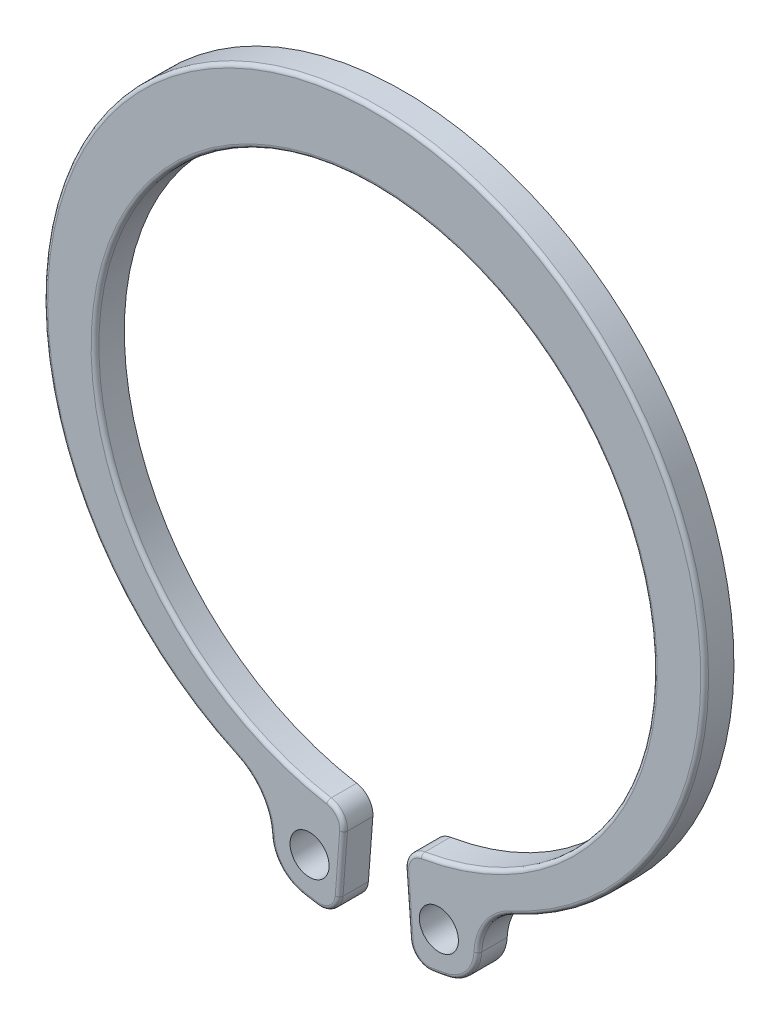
ISO-10303-21;
HEADER;
FILE_DESCRIPTION(('STEP AP214'),'2;1');
FILE_NAME('part.step','',(''),(''),'','','');
FILE_SCHEMA(('AUTOMOTIVE_DESIGN { 1 0 10303 214 1 1 1 1 }'));
ENDSEC;
DATA;
#1=APPLICATION_CONTEXT('core data for automotive mechanical design processes');
#2=APPLICATION_PROTOCOL_DEFINITION('international standard','automotive_design',2000,#1);
#3=PRODUCT_CONTEXT('',#1,'mechanical');
#4=PRODUCT('Part','Part','',(#3));
#5=PRODUCT_RELATED_PRODUCT_CATEGORY('part','',(#4));
#6=PRODUCT_DEFINITION_FORMATION('','',#4);
#7=PRODUCT_DEFINITION_CONTEXT('part definition',#1,'design');
#8=PRODUCT_DEFINITION('design','',#6,#7);
#9=PRODUCT_DEFINITION_SHAPE('','',#8);
#10=(LENGTH_UNIT() NAMED_UNIT(*) SI_UNIT(.MILLI.,.METRE.));
#11=(NAMED_UNIT(*) PLANE_ANGLE_UNIT() SI_UNIT($,.RADIAN.));
#12=(NAMED_UNIT(*) SI_UNIT($,.STERADIAN.) SOLID_ANGLE_UNIT());
#13=UNCERTAINTY_MEASURE_WITH_UNIT(LENGTH_MEASURE(1.E-05),#10,'distance_accuracy_value','');
#14=(GEOMETRIC_REPRESENTATION_CONTEXT(3) GLOBAL_UNCERTAINTY_ASSIGNED_CONTEXT((#13)) GLOBAL_UNIT_ASSIGNED_CONTEXT((#10,
#11,#12)) REPRESENTATION_CONTEXT('',''));
#15=CARTESIAN_POINT('',(0.,0.,0.));
#16=DIRECTION('',(0.,0.,1.));
#17=DIRECTION('',(1.,0.,0.));
#18=AXIS2_PLACEMENT_3D('',#15,#16,#17);
#19=CARTESIAN_POINT('',(0.,0.,1.5));
#20=DIRECTION('',(0.,0.,1.));
#21=DIRECTION('',(1.,0.,0.));
#22=AXIS2_PLACEMENT_3D('',#19,#20,#21);
#23=PLANE('',#22);
#24=DIRECTION('',(0.0761165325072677,0.997098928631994,0.));
#25=VECTOR('',#24,1.);
#26=CARTESIAN_POINT('',(-1.76789289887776,-15.1442562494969,1.5));
#27=LINE('',#26,#25);
#28=CARTESIAN_POINT('',(-1.99694134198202,-18.1447076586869,1.5));
#29=VERTEX_POINT('',#28);
#30=CARTESIAN_POINT('',(-1.76789289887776,-15.1442562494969,1.5));
#31=VERTEX_POINT('',#30);
#32=EDGE_CURVE('E277',#29,#31,#27,.T.);
#33=ORIENTED_EDGE('',*,*,#32,.T.);
#34=CARTESIAN_POINT('',(-2.56557204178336,-15.0833630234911,1.5));
#35=DIRECTION('',(0.,0.,1.));
#36=DIRECTION('',(1.,0.,0.));
#37=AXIS2_PLACEMENT_3D('',#34,#35,#36);
#38=CIRCLE('',#37,0.8);
#39=CARTESIAN_POINT('',(-2.43142448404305,-14.2946904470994,1.5));
#40=VERTEX_POINT('',#39);
#41=EDGE_CURVE('E279',#31,#40,#38,.T.);
#42=ORIENTED_EDGE('',*,*,#41,.T.);
#43=CARTESIAN_POINT('',(0.,0.,1.5));
#44=DIRECTION('',(0.,0.,1.));
#45=DIRECTION('',(1.,0.,0.));
#46=AXIS2_PLACEMENT_3D('',#43,#44,#45);
#47=CIRCLE('',#46,14.5);
#48=CARTESIAN_POINT('',(2.43142448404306,-14.2946904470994,1.5));
#49=VERTEX_POINT('',#48);
#50=EDGE_CURVE('E253',#40,#49,#47,.F.);
#51=ORIENTED_EDGE('',*,*,#50,.T.);
#52=CARTESIAN_POINT('',(2.56557204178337,-15.0833630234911,1.5));
#53=DIRECTION('',(0.,0.,1.));
#54=DIRECTION('',(1.,0.,0.));
#55=AXIS2_PLACEMENT_3D('',#52,#53,#54);
#56=CIRCLE('',#55,0.8);
#57=CARTESIAN_POINT('',(1.76789289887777,-15.1442562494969,1.5));
#58=VERTEX_POINT('',#57);
#59=EDGE_CURVE('E255',#49,#58,#56,.T.);
#60=ORIENTED_EDGE('',*,*,#59,.T.);
#61=DIRECTION('',(0.076116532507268,-0.997098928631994,0.));
#62=VECTOR('',#61,1.);
#63=CARTESIAN_POINT('',(1.99694134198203,-18.1447076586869,1.5));
#64=LINE('',#63,#62);
#65=CARTESIAN_POINT('',(1.99694134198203,-18.1447076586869,1.5));
#66=VERTEX_POINT('',#65);
#67=EDGE_CURVE('E257',#58,#66,#64,.T.);
#68=ORIENTED_EDGE('',*,*,#67,.T.);
#69=CARTESIAN_POINT('',(2.79462048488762,-18.083814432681,1.5));
#70=DIRECTION('',(0.,0.,1.));
#71=DIRECTION('',(1.,0.,0.));
#72=AXIS2_PLACEMENT_3D('',#69,#70,#71);
#73=CIRCLE('',#72,0.8);
#74=CARTESIAN_POINT('',(2.91679985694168,-18.8744295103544,1.5));
#75=VERTEX_POINT('',#74);
#76=EDGE_CURVE('E259',#66,#75,#73,.T.);
#77=ORIENTED_EDGE('',*,*,#76,.T.);
#78=CARTESIAN_POINT('',(0.,0.,1.5));
#79=DIRECTION('',(0.,0.,1.));
#80=DIRECTION('',(1.,0.,0.));
#81=AXIS2_PLACEMENT_3D('',#78,#79,#80);
#82=CIRCLE('',#81,19.0984766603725);
#83=CARTESIAN_POINT('',(3.6566155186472,-18.7451586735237,1.5));
#84=VERTEX_POINT('',#83);
#85=EDGE_CURVE('E261',#75,#84,#82,.T.);
#86=ORIENTED_EDGE('',*,*,#85,.T.);
#87=CARTESIAN_POINT('',(3.31198552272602,-16.9784583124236,1.5));
#88=DIRECTION('',(0.,0.,1.));
#89=DIRECTION('',(1.,0.,0.));
#90=AXIS2_PLACEMENT_3D('',#87,#88,#89);
#91=CIRCLE('',#90,1.8);
#92=CARTESIAN_POINT('',(5.1095864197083,-17.0713615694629,1.5));
#93=VERTEX_POINT('',#92);
#94=EDGE_CURVE('E263',#84,#93,#91,.T.);
#95=ORIENTED_EDGE('',*,*,#94,.T.);
#96=CARTESIAN_POINT('',(8.30532134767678,-17.2365229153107,1.5));
#97=DIRECTION('',(0.,0.,1.));
#98=DIRECTION('',(1.,0.,0.));
#99=AXIS2_PLACEMENT_3D('',#96,#97,#98);
#100=CIRCLE('',#99,3.2);
#101=CARTESIAN_POINT('',(6.97146798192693,-14.327771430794,1.5));
#102=VERTEX_POINT('',#101);
#103=EDGE_CURVE('E265',#93,#102,#100,.F.);
#104=ORIENTED_EDGE('',*,*,#103,.T.);
#105=CARTESIAN_POINT('',(0.,0.875,1.5));
#106=DIRECTION('',(0.,0.,1.));
#107=DIRECTION('',(1.,0.,0.));
#108=AXIS2_PLACEMENT_3D('',#105,#106,#107);
#109=CIRCLE('',#108,16.725);
#110=CARTESIAN_POINT('',(-6.97146798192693,-14.327771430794,1.5));
#111=VERTEX_POINT('',#110);
#112=EDGE_CURVE('E267',#102,#111,#109,.T.);
#113=ORIENTED_EDGE('',*,*,#112,.T.);
#114=CARTESIAN_POINT('',(-8.30532134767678,-17.2365229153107,1.5));
#115=DIRECTION('',(0.,0.,1.));
#116=DIRECTION('',(1.,0.,0.));
#117=AXIS2_PLACEMENT_3D('',#114,#115,#116);
#118=CIRCLE('',#117,3.2);
#119=CARTESIAN_POINT('',(-5.10958641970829,-17.0713615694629,1.5));
#120=VERTEX_POINT('',#119);
#121=EDGE_CURVE('E269',#111,#120,#118,.F.);
#122=ORIENTED_EDGE('',*,*,#121,.T.);
#123=CARTESIAN_POINT('',(-3.31198552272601,-16.9784583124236,1.5));
#124=DIRECTION('',(0.,0.,1.));
#125=DIRECTION('',(1.,0.,0.));
#126=AXIS2_PLACEMENT_3D('',#123,#124,#125);
#127=CIRCLE('',#126,1.8);
#128=CARTESIAN_POINT('',(-3.65661551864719,-18.7451586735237,1.5));
#129=VERTEX_POINT('',#128);
#130=EDGE_CURVE('E271',#120,#129,#127,.T.);
#131=ORIENTED_EDGE('',*,*,#130,.T.);
#132=CARTESIAN_POINT('',(0.,0.,1.5));
#133=DIRECTION('',(0.,0.,1.));
#134=DIRECTION('',(1.,0.,0.));
#135=AXIS2_PLACEMENT_3D('',#132,#133,#134);
#136=CIRCLE('',#135,19.0984766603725);
#137=CARTESIAN_POINT('',(-2.91679985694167,-18.8744295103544,1.5));
#138=VERTEX_POINT('',#137);
#139=EDGE_CURVE('E273',#129,#138,#136,.T.);
#140=ORIENTED_EDGE('',*,*,#139,.T.);
#141=CARTESIAN_POINT('',(-2.79462048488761,-18.083814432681,1.5));
#142=DIRECTION('',(0.,0.,1.));
#143=DIRECTION('',(1.,0.,0.));
#144=AXIS2_PLACEMENT_3D('',#141,#142,#143);
#145=CIRCLE('',#144,0.8);
#146=EDGE_CURVE('E275',#138,#29,#145,.T.);
#147=ORIENTED_EDGE('',*,*,#146,.T.);
#148=EDGE_LOOP('',(#33,#42,#51,#60,#68,#77,#86,#95,#104,#113,#122,#131,#140,#147));
#149=FACE_BOUND('',#148,.T.);
#150=CARTESIAN_POINT('',(-3.31198552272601,-16.9784583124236,1.5));
#151=DIRECTION('',(0.,0.,1.));
#152=DIRECTION('',(-1.,0.,0.));
#153=AXIS2_PLACEMENT_3D('',#150,#151,#152);
#154=CIRCLE('',#153,1.);
#155=CARTESIAN_POINT('',(-4.31198552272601,-16.9784583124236,1.5));
#156=VERTEX_POINT('',#155);
#157=EDGE_CURVE('E412',#156,#156,#154,.T.);
#158=ORIENTED_EDGE('',*,*,#157,.F.);
#159=EDGE_LOOP('',(#158));
#160=FACE_BOUND('',#159,.T.);
#161=CARTESIAN_POINT('',(3.31198552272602,-16.9784583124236,1.5));
#162=DIRECTION('',(0.,0.,1.));
#163=DIRECTION('',(1.,0.,0.));
#164=AXIS2_PLACEMENT_3D('',#161,#162,#163);
#165=CIRCLE('',#164,1.);
#166=CARTESIAN_POINT('',(4.31198552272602,-16.9784583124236,1.5));
#167=VERTEX_POINT('',#166);
#168=EDGE_CURVE('E406',#167,#167,#165,.T.);
#169=ORIENTED_EDGE('',*,*,#168,.F.);
#170=EDGE_LOOP('',(#169));
#171=FACE_BOUND('',#170,.T.);
#172=ADVANCED_FACE('F30',(#149,#160,#171),#23,.T.);
#173=CARTESIAN_POINT('',(0.,0.,0.));
#174=DIRECTION('',(0.,0.,1.));
#175=DIRECTION('',(1.,0.,0.));
#176=AXIS2_PLACEMENT_3D('',#173,#174,#175);
#177=PLANE('',#176);
#178=CARTESIAN_POINT('',(-3.31198552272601,-16.9784583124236,0.));
#179=DIRECTION('',(0.,0.,1.));
#180=DIRECTION('',(-1.,0.,0.));
#181=AXIS2_PLACEMENT_3D('',#178,#179,#180);
#182=CIRCLE('',#181,1.);
#183=CARTESIAN_POINT('',(-4.31198552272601,-16.9784583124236,0.));
#184=VERTEX_POINT('',#183);
#185=EDGE_CURVE('E409',#184,#184,#182,.T.);
#186=ORIENTED_EDGE('',*,*,#185,.T.);
#187=EDGE_LOOP('',(#186));
#188=FACE_BOUND('',#187,.T.);
#189=CARTESIAN_POINT('',(0.,0.,0.));
#190=DIRECTION('',(0.,0.,1.));
#191=DIRECTION('',(1.,0.,0.));
#192=AXIS2_PLACEMENT_3D('',#189,#190,#191);
#193=CIRCLE('',#192,19.2984766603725);
#194=CARTESIAN_POINT('',(2.94734469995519,-19.0720832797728,0.));
#195=VERTEX_POINT('',#194);
#196=CARTESIAN_POINT('',(3.69490774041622,-18.941458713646,0.));
#197=VERTEX_POINT('',#196);
#198=EDGE_CURVE('E188',#195,#197,#193,.T.);
#199=ORIENTED_EDGE('',*,*,#198,.F.);
#200=CARTESIAN_POINT('',(2.79462048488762,-18.083814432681,0.));
#201=DIRECTION('',(0.,0.,1.));
#202=DIRECTION('',(1.,0.,0.));
#203=AXIS2_PLACEMENT_3D('',#200,#201,#202);
#204=CIRCLE('',#203,1.);
#205=CARTESIAN_POINT('',(1.79752155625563,-18.1599309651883,0.));
#206=VERTEX_POINT('',#205);
#207=EDGE_CURVE('E235',#195,#206,#204,.F.);
#208=ORIENTED_EDGE('',*,*,#207,.T.);
#209=DIRECTION('',(0.076116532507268,-0.997098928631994,0.));
#210=VECTOR('',#209,1.);
#211=CARTESIAN_POINT('',(1.49686515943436,-14.2214413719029,0.));
#212=LINE('',#211,#210);
#213=CARTESIAN_POINT('',(1.56847311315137,-15.1594795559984,0.));
#214=VERTEX_POINT('',#213);
#215=EDGE_CURVE('E193',#214,#206,#212,.T.);
#216=ORIENTED_EDGE('',*,*,#215,.F.);
#217=CARTESIAN_POINT('',(2.56557204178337,-15.0833630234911,0.));
#218=DIRECTION('',(0.,0.,1.));
#219=DIRECTION('',(1.,0.,0.));
#220=AXIS2_PLACEMENT_3D('',#217,#218,#219);
#221=CIRCLE('',#220,1.);
#222=CARTESIAN_POINT('',(2.39788759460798,-14.0975223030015,0.));
#223=VERTEX_POINT('',#222);
#224=EDGE_CURVE('E231',#214,#223,#221,.F.);
#225=ORIENTED_EDGE('',*,*,#224,.T.);
#226=CARTESIAN_POINT('',(0.,0.,0.));
#227=DIRECTION('',(0.,0.,-1.));
#228=DIRECTION('',(1.,0.,0.));
#229=AXIS2_PLACEMENT_3D('',#226,#227,#228);
#230=CIRCLE('',#229,14.3);
#231=CARTESIAN_POINT('',(-2.39788759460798,-14.0975223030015,0.));
#232=VERTEX_POINT('',#231);
#233=EDGE_CURVE('E415',#232,#223,#230,.T.);
#234=ORIENTED_EDGE('',*,*,#233,.F.);
#235=CARTESIAN_POINT('',(-2.56557204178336,-15.0833630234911,0.));
#236=DIRECTION('',(0.,0.,1.));
#237=DIRECTION('',(1.,0.,0.));
#238=AXIS2_PLACEMENT_3D('',#235,#236,#237);
#239=CIRCLE('',#238,1.);
#240=CARTESIAN_POINT('',(-1.56847311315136,-15.1594795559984,0.));
#241=VERTEX_POINT('',#240);
#242=EDGE_CURVE('E229',#232,#241,#239,.F.);
#243=ORIENTED_EDGE('',*,*,#242,.T.);
#244=DIRECTION('',(0.0761165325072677,0.997098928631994,0.));
#245=VECTOR('',#244,1.);
#246=CARTESIAN_POINT('',(-1.49686515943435,-14.2214413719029,0.));
#247=LINE('',#246,#245);
#248=CARTESIAN_POINT('',(-1.79752155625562,-18.1599309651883,0.));
#249=VERTEX_POINT('',#248);
#250=EDGE_CURVE('E216',#249,#241,#247,.T.);
#251=ORIENTED_EDGE('',*,*,#250,.F.);
#252=CARTESIAN_POINT('',(-2.79462048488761,-18.083814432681,0.));
#253=DIRECTION('',(0.,0.,1.));
#254=DIRECTION('',(1.,0.,0.));
#255=AXIS2_PLACEMENT_3D('',#252,#253,#254);
#256=CIRCLE('',#255,1.);
#257=CARTESIAN_POINT('',(-2.94734469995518,-19.0720832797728,0.));
#258=VERTEX_POINT('',#257);
#259=EDGE_CURVE('E233',#249,#258,#256,.F.);
#260=ORIENTED_EDGE('',*,*,#259,.T.);
#261=CARTESIAN_POINT('',(0.,0.,0.));
#262=DIRECTION('',(0.,0.,1.));
#263=DIRECTION('',(-1.,0.,0.));
#264=AXIS2_PLACEMENT_3D('',#261,#262,#263);
#265=CIRCLE('',#264,19.2984766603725);
#266=CARTESIAN_POINT('',(-3.69490774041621,-18.941458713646,0.));
#267=VERTEX_POINT('',#266);
#268=EDGE_CURVE('E213',#267,#258,#265,.T.);
#269=ORIENTED_EDGE('',*,*,#268,.F.);
#270=CARTESIAN_POINT('',(-3.31198552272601,-16.9784583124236,0.));
#271=DIRECTION('',(0.,0.,1.));
#272=DIRECTION('',(-1.,0.,0.));
#273=AXIS2_PLACEMENT_3D('',#270,#271,#272);
#274=CIRCLE('',#273,2.);
#275=CARTESIAN_POINT('',(-5.30931985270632,-17.0816841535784,0.));
#276=VERTEX_POINT('',#275);
#277=EDGE_CURVE('E210',#276,#267,#274,.T.);
#278=ORIENTED_EDGE('',*,*,#277,.F.);
#279=CARTESIAN_POINT('',(-8.30532134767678,-17.2365229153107,0.));
#280=DIRECTION('',(0.,0.,-1.));
#281=DIRECTION('',(-1.,0.,0.));
#282=AXIS2_PLACEMENT_3D('',#279,#280,#281);
#283=CIRCLE('',#282,3.);
#284=CARTESIAN_POINT('',(-7.05483381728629,-14.5095683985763,0.));
#285=VERTEX_POINT('',#284);
#286=EDGE_CURVE('E207',#285,#276,#283,.T.);
#287=ORIENTED_EDGE('',*,*,#286,.F.);
#288=CARTESIAN_POINT('',(0.,0.875,0.));
#289=DIRECTION('',(0.,0.,1.));
#290=DIRECTION('',(1.,0.,0.));
#291=AXIS2_PLACEMENT_3D('',#288,#289,#290);
#292=CIRCLE('',#291,16.925);
#293=CARTESIAN_POINT('',(7.0548338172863,-14.5095683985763,0.));
#294=VERTEX_POINT('',#293);
#295=EDGE_CURVE('E201',#294,#285,#292,.T.);
#296=ORIENTED_EDGE('',*,*,#295,.F.);
#297=CARTESIAN_POINT('',(8.30532134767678,-17.2365229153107,0.));
#298=DIRECTION('',(0.,0.,-1.));
#299=DIRECTION('',(1.,0.,0.));
#300=AXIS2_PLACEMENT_3D('',#297,#298,#299);
#301=CIRCLE('',#300,3.);
#302=CARTESIAN_POINT('',(5.30931985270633,-17.0816841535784,0.));
#303=VERTEX_POINT('',#302);
#304=EDGE_CURVE('E199',#303,#294,#301,.T.);
#305=ORIENTED_EDGE('',*,*,#304,.F.);
#306=CARTESIAN_POINT('',(3.31198552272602,-16.9784583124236,0.));
#307=DIRECTION('',(0.,0.,1.));
#308=DIRECTION('',(1.,0.,0.));
#309=AXIS2_PLACEMENT_3D('',#306,#307,#308);
#310=CIRCLE('',#309,2.);
#311=EDGE_CURVE('E178',#197,#303,#310,.T.);
#312=ORIENTED_EDGE('',*,*,#311,.F.);
#313=EDGE_LOOP('',(#199,#208,#216,#225,#234,#243,#251,#260,#269,#278,#287,#296,#305,#312));
#314=FACE_BOUND('',#313,.T.);
#315=CARTESIAN_POINT('',(3.31198552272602,-16.9784583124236,0.));
#316=DIRECTION('',(0.,0.,1.));
#317=DIRECTION('',(1.,0.,0.));
#318=AXIS2_PLACEMENT_3D('',#315,#316,#317);
#319=CIRCLE('',#318,1.);
#320=CARTESIAN_POINT('',(4.31198552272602,-16.9784583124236,0.));
#321=VERTEX_POINT('',#320);
#322=EDGE_CURVE('E403',#321,#321,#319,.T.);
#323=ORIENTED_EDGE('',*,*,#322,.T.);
#324=EDGE_LOOP('',(#323));
#325=FACE_BOUND('',#324,.T.);
#326=ADVANCED_FACE('F195',(#188,#314,#325),#177,.F.);
#327=CARTESIAN_POINT('',(0.,0.,1.5));
#328=DIRECTION('',(0.,0.,-1.));
#329=DIRECTION('',(-1.,0.,0.));
#330=AXIS2_PLACEMENT_3D('',#327,#328,#329);
#331=CYLINDRICAL_SURFACE('',#330,14.3);
#332=DIRECTION('',(0.,0.,-1.));
#333=VECTOR('',#332,1.);
#334=CARTESIAN_POINT('',(2.39788759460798,-14.0975223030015,1.5));
#335=LINE('',#334,#333);
#336=CARTESIAN_POINT('',(2.39788759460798,-14.0975223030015,1.3));
#337=VERTEX_POINT('',#336);
#338=EDGE_CURVE('E251',#223,#337,#335,.F.);
#339=ORIENTED_EDGE('',*,*,#338,.T.);
#340=CARTESIAN_POINT('',(0.,0.,1.3));
#341=DIRECTION('',(0.,0.,1.));
#342=DIRECTION('',(1.,0.,0.));
#343=AXIS2_PLACEMENT_3D('',#340,#341,#342);
#344=CIRCLE('',#343,14.3);
#345=CARTESIAN_POINT('',(-2.39788759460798,-14.0975223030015,1.3));
#346=VERTEX_POINT('',#345);
#347=EDGE_CURVE('E11',#337,#346,#344,.T.);
#348=ORIENTED_EDGE('',*,*,#347,.T.);
#349=DIRECTION('',(0.,0.,-1.));
#350=VECTOR('',#349,1.);
#351=CARTESIAN_POINT('',(-2.39788759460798,-14.0975223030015,1.5));
#352=LINE('',#351,#350);
#353=EDGE_CURVE('E249',#346,#232,#352,.T.);
#354=ORIENTED_EDGE('',*,*,#353,.T.);
#355=ORIENTED_EDGE('',*,*,#233,.T.);
#356=EDGE_LOOP('',(#339,#348,#354,#355));
#357=FACE_BOUND('',#356,.T.);
#358=ADVANCED_FACE('F32',(#357),#331,.F.);
#359=CARTESIAN_POINT('',(1.49686515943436,-14.2214413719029,1.5));
#360=DIRECTION('',(0.997098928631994,0.076116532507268,0.));
#361=DIRECTION('',(-0.076116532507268,0.997098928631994,0.));
#362=AXIS2_PLACEMENT_3D('',#359,#360,#361);
#363=PLANE('',#362);
#364=DIRECTION('',(0.,0.,-1.));
#365=VECTOR('',#364,1.);
#366=CARTESIAN_POINT('',(1.79752155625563,-18.1599309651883,1.5));
#367=LINE('',#366,#365);
#368=CARTESIAN_POINT('',(1.79752155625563,-18.1599309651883,1.3));
#369=VERTEX_POINT('',#368);
#370=EDGE_CURVE('E239',#206,#369,#367,.F.);
#371=ORIENTED_EDGE('',*,*,#370,.T.);
#372=DIRECTION('',(0.076116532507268,-0.997098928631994,0.));
#373=VECTOR('',#372,1.);
#374=CARTESIAN_POINT('',(1.56847311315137,-15.1594795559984,1.3));
#375=LINE('',#374,#373);
#376=CARTESIAN_POINT('',(1.56847311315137,-15.1594795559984,1.3));
#377=VERTEX_POINT('',#376);
#378=EDGE_CURVE('E52',#369,#377,#375,.F.);
#379=ORIENTED_EDGE('',*,*,#378,.T.);
#380=DIRECTION('',(0.,0.,-1.));
#381=VECTOR('',#380,1.);
#382=CARTESIAN_POINT('',(1.56847311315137,-15.1594795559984,1.5));
#383=LINE('',#382,#381);
#384=EDGE_CURVE('E237',#377,#214,#383,.T.);
#385=ORIENTED_EDGE('',*,*,#384,.T.);
#386=ORIENTED_EDGE('',*,*,#215,.T.);
#387=EDGE_LOOP('',(#371,#379,#385,#386));
#388=FACE_BOUND('',#387,.T.);
#389=ADVANCED_FACE('F313',(#388),#363,.F.);
#390=CARTESIAN_POINT('',(0.,0.,1.5));
#391=DIRECTION('',(0.,0.,-1.));
#392=DIRECTION('',(-1.,0.,0.));
#393=AXIS2_PLACEMENT_3D('',#390,#391,#392);
#394=CYLINDRICAL_SURFACE('',#393,19.2984766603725);
#395=DIRECTION('',(0.,0.,-1.));
#396=VECTOR('',#395,1.);
#397=CARTESIAN_POINT('',(3.69490774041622,-18.941458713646,1.5));
#398=LINE('',#397,#396);
#399=CARTESIAN_POINT('',(3.69490774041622,-18.941458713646,1.3));
#400=VERTEX_POINT('',#399);
#401=EDGE_CURVE('E173',#400,#197,#398,.T.);
#402=ORIENTED_EDGE('',*,*,#401,.F.);
#403=CARTESIAN_POINT('',(0.,0.,1.3));
#404=DIRECTION('',(0.,0.,1.));
#405=DIRECTION('',(1.,0.,0.));
#406=AXIS2_PLACEMENT_3D('',#403,#404,#405);
#407=CIRCLE('',#406,19.2984766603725);
#408=CARTESIAN_POINT('',(2.94734469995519,-19.0720832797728,1.3));
#409=VERTEX_POINT('',#408);
#410=EDGE_CURVE('E300',#400,#409,#407,.F.);
#411=ORIENTED_EDGE('',*,*,#410,.T.);
#412=DIRECTION('',(0.,0.,-1.));
#413=VECTOR('',#412,1.);
#414=CARTESIAN_POINT('',(2.94734469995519,-19.0720832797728,1.5));
#415=LINE('',#414,#413);
#416=EDGE_CURVE('E184',#409,#195,#415,.T.);
#417=ORIENTED_EDGE('',*,*,#416,.T.);
#418=ORIENTED_EDGE('',*,*,#198,.T.);
#419=EDGE_LOOP('',(#402,#411,#417,#418));
#420=FACE_BOUND('',#419,.T.);
#421=ADVANCED_FACE('F189',(#420),#394,.T.);
#422=CARTESIAN_POINT('',(3.31198552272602,-16.9784583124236,1.5));
#423=DIRECTION('',(0.,0.,-1.));
#424=DIRECTION('',(-1.,0.,0.));
#425=AXIS2_PLACEMENT_3D('',#422,#423,#424);
#426=CYLINDRICAL_SURFACE('',#425,2.);
#427=DIRECTION('',(0.,0.,-1.));
#428=VECTOR('',#427,1.);
#429=CARTESIAN_POINT('',(5.30931985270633,-17.0816841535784,1.5));
#430=LINE('',#429,#428);
#431=CARTESIAN_POINT('',(5.30931985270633,-17.0816841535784,1.3));
#432=VERTEX_POINT('',#431);
#433=EDGE_CURVE('E185',#432,#303,#430,.T.);
#434=ORIENTED_EDGE('',*,*,#433,.F.);
#435=CARTESIAN_POINT('',(3.31198552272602,-16.9784583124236,1.3));
#436=DIRECTION('',(0.,0.,1.));
#437=DIRECTION('',(1.,0.,0.));
#438=AXIS2_PLACEMENT_3D('',#435,#436,#437);
#439=CIRCLE('',#438,2.);
#440=EDGE_CURVE('E181',#432,#400,#439,.F.);
#441=ORIENTED_EDGE('',*,*,#440,.T.);
#442=ORIENTED_EDGE('',*,*,#401,.T.);
#443=ORIENTED_EDGE('',*,*,#311,.T.);
#444=EDGE_LOOP('',(#434,#441,#442,#443));
#445=FACE_BOUND('',#444,.T.);
#446=ADVANCED_FACE('F176',(#445),#426,.T.);
#447=CARTESIAN_POINT('',(8.30532134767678,-17.2365229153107,1.5));
#448=DIRECTION('',(0.,0.,-1.));
#449=DIRECTION('',(-1.,0.,0.));
#450=AXIS2_PLACEMENT_3D('',#447,#448,#449);
#451=CYLINDRICAL_SURFACE('',#450,3.);
#452=DIRECTION('',(0.,0.,-1.));
#453=VECTOR('',#452,1.);
#454=CARTESIAN_POINT('',(7.0548338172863,-14.5095683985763,1.5));
#455=LINE('',#454,#453);
#456=CARTESIAN_POINT('',(7.0548338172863,-14.5095683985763,1.3));
#457=VERTEX_POINT('',#456);
#458=EDGE_CURVE('E225',#457,#294,#455,.T.);
#459=ORIENTED_EDGE('',*,*,#458,.F.);
#460=CARTESIAN_POINT('',(8.30532134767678,-17.2365229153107,1.3));
#461=DIRECTION('',(0.,0.,1.));
#462=DIRECTION('',(1.,0.,0.));
#463=AXIS2_PLACEMENT_3D('',#460,#461,#462);
#464=CIRCLE('',#463,3.);
#465=EDGE_CURVE('E297',#457,#432,#464,.T.);
#466=ORIENTED_EDGE('',*,*,#465,.T.);
#467=ORIENTED_EDGE('',*,*,#433,.T.);
#468=ORIENTED_EDGE('',*,*,#304,.T.);
#469=EDGE_LOOP('',(#459,#466,#467,#468));
#470=FACE_BOUND('',#469,.T.);
#471=ADVANCED_FACE('F456',(#470),#451,.F.);
#472=CARTESIAN_POINT('',(0.,0.875,1.5));
#473=DIRECTION('',(0.,0.,-1.));
#474=DIRECTION('',(-1.,0.,0.));
#475=AXIS2_PLACEMENT_3D('',#472,#473,#474);
#476=CYLINDRICAL_SURFACE('',#475,16.925);
#477=DIRECTION('',(0.,0.,-1.));
#478=VECTOR('',#477,1.);
#479=CARTESIAN_POINT('',(-7.05483381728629,-14.5095683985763,1.5));
#480=LINE('',#479,#478);
#481=CARTESIAN_POINT('',(-7.05483381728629,-14.5095683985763,1.3));
#482=VERTEX_POINT('',#481);
#483=EDGE_CURVE('E223',#482,#285,#480,.T.);
#484=ORIENTED_EDGE('',*,*,#483,.F.);
#485=CARTESIAN_POINT('',(0.,0.875,1.3));
#486=DIRECTION('',(0.,0.,1.));
#487=DIRECTION('',(1.,0.,0.));
#488=AXIS2_PLACEMENT_3D('',#485,#486,#487);
#489=CIRCLE('',#488,16.925);
#490=EDGE_CURVE('E295',#482,#457,#489,.F.);
#491=ORIENTED_EDGE('',*,*,#490,.T.);
#492=ORIENTED_EDGE('',*,*,#458,.T.);
#493=ORIENTED_EDGE('',*,*,#295,.T.);
#494=EDGE_LOOP('',(#484,#491,#492,#493));
#495=FACE_BOUND('',#494,.T.);
#496=ADVANCED_FACE('F452',(#495),#476,.T.);
#497=CARTESIAN_POINT('',(-8.30532134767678,-17.2365229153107,1.5));
#498=DIRECTION('',(0.,0.,-1.));
#499=DIRECTION('',(-1.,0.,0.));
#500=AXIS2_PLACEMENT_3D('',#497,#498,#499);
#501=CYLINDRICAL_SURFACE('',#500,3.);
#502=DIRECTION('',(0.,0.,-1.));
#503=VECTOR('',#502,1.);
#504=CARTESIAN_POINT('',(-5.30931985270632,-17.0816841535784,1.5));
#505=LINE('',#504,#503);
#506=CARTESIAN_POINT('',(-5.30931985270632,-17.0816841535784,1.3));
#507=VERTEX_POINT('',#506);
#508=EDGE_CURVE('E221',#507,#276,#505,.T.);
#509=ORIENTED_EDGE('',*,*,#508,.F.);
#510=CARTESIAN_POINT('',(-8.30532134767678,-17.2365229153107,1.3));
#511=DIRECTION('',(0.,0.,1.));
#512=DIRECTION('',(1.,0.,0.));
#513=AXIS2_PLACEMENT_3D('',#510,#511,#512);
#514=CIRCLE('',#513,3.);
#515=EDGE_CURVE('E293',#507,#482,#514,.T.);
#516=ORIENTED_EDGE('',*,*,#515,.T.);
#517=ORIENTED_EDGE('',*,*,#483,.T.);
#518=ORIENTED_EDGE('',*,*,#286,.T.);
#519=EDGE_LOOP('',(#509,#516,#517,#518));
#520=FACE_BOUND('',#519,.T.);
#521=ADVANCED_FACE('F448',(#520),#501,.F.);
#522=CARTESIAN_POINT('',(-3.31198552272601,-16.9784583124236,1.5));
#523=DIRECTION('',(0.,0.,-1.));
#524=DIRECTION('',(-1.,0.,0.));
#525=AXIS2_PLACEMENT_3D('',#522,#523,#524);
#526=CYLINDRICAL_SURFACE('',#525,2.);
#527=DIRECTION('',(0.,0.,-1.));
#528=VECTOR('',#527,1.);
#529=CARTESIAN_POINT('',(-3.69490774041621,-18.941458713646,1.5));
#530=LINE('',#529,#528);
#531=CARTESIAN_POINT('',(-3.69490774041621,-18.941458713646,1.3));
#532=VERTEX_POINT('',#531);
#533=EDGE_CURVE('E219',#532,#267,#530,.T.);
#534=ORIENTED_EDGE('',*,*,#533,.F.);
#535=CARTESIAN_POINT('',(-3.31198552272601,-16.9784583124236,1.3));
#536=DIRECTION('',(0.,0.,1.));
#537=DIRECTION('',(1.,0.,0.));
#538=AXIS2_PLACEMENT_3D('',#535,#536,#537);
#539=CIRCLE('',#538,2.);
#540=EDGE_CURVE('E291',#532,#507,#539,.F.);
#541=ORIENTED_EDGE('',*,*,#540,.T.);
#542=ORIENTED_EDGE('',*,*,#508,.T.);
#543=ORIENTED_EDGE('',*,*,#277,.T.);
#544=EDGE_LOOP('',(#534,#541,#542,#543));
#545=FACE_BOUND('',#544,.T.);
#546=ADVANCED_FACE('F444',(#545),#526,.T.);
#547=CARTESIAN_POINT('',(0.,0.,1.5));
#548=DIRECTION('',(0.,0.,-1.));
#549=DIRECTION('',(-1.,0.,0.));
#550=AXIS2_PLACEMENT_3D('',#547,#548,#549);
#551=CYLINDRICAL_SURFACE('',#550,19.2984766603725);
#552=DIRECTION('',(0.,0.,-1.));
#553=VECTOR('',#552,1.);
#554=CARTESIAN_POINT('',(-2.94734469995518,-19.0720832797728,1.5));
#555=LINE('',#554,#553);
#556=CARTESIAN_POINT('',(-2.94734469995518,-19.0720832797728,1.3));
#557=VERTEX_POINT('',#556);
#558=EDGE_CURVE('E246',#258,#557,#555,.F.);
#559=ORIENTED_EDGE('',*,*,#558,.T.);
#560=CARTESIAN_POINT('',(0.,0.,1.3));
#561=DIRECTION('',(0.,0.,1.));
#562=DIRECTION('',(1.,0.,0.));
#563=AXIS2_PLACEMENT_3D('',#560,#561,#562);
#564=CIRCLE('',#563,19.2984766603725);
#565=EDGE_CURVE('E289',#557,#532,#564,.F.);
#566=ORIENTED_EDGE('',*,*,#565,.T.);
#567=ORIENTED_EDGE('',*,*,#533,.T.);
#568=ORIENTED_EDGE('',*,*,#268,.T.);
#569=EDGE_LOOP('',(#559,#566,#567,#568));
#570=FACE_BOUND('',#569,.T.);
#571=ADVANCED_FACE('F441',(#570),#551,.T.);
#572=CARTESIAN_POINT('',(-1.49686515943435,-14.2214413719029,1.5));
#573=DIRECTION('',(-0.997098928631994,0.0761165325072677,0.));
#574=DIRECTION('',(-0.0761165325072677,-0.997098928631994,0.));
#575=AXIS2_PLACEMENT_3D('',#572,#573,#574);
#576=PLANE('',#575);
#577=DIRECTION('',(0.,0.,-1.));
#578=VECTOR('',#577,1.);
#579=CARTESIAN_POINT('',(-1.56847311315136,-15.1594795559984,1.5));
#580=LINE('',#579,#578);
#581=CARTESIAN_POINT('',(-1.56847311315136,-15.1594795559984,1.3));
#582=VERTEX_POINT('',#581);
#583=EDGE_CURVE('E241',#241,#582,#580,.F.);
#584=ORIENTED_EDGE('',*,*,#583,.T.);
#585=DIRECTION('',(0.0761165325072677,0.997098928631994,0.));
#586=VECTOR('',#585,1.);
#587=CARTESIAN_POINT('',(-1.79752155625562,-18.1599309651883,1.3));
#588=LINE('',#587,#586);
#589=CARTESIAN_POINT('',(-1.79752155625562,-18.1599309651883,1.3));
#590=VERTEX_POINT('',#589);
#591=EDGE_CURVE('E285',#582,#590,#588,.F.);
#592=ORIENTED_EDGE('',*,*,#591,.T.);
#593=DIRECTION('',(0.,0.,-1.));
#594=VECTOR('',#593,1.);
#595=CARTESIAN_POINT('',(-1.79752155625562,-18.1599309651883,1.5));
#596=LINE('',#595,#594);
#597=EDGE_CURVE('E244',#590,#249,#596,.T.);
#598=ORIENTED_EDGE('',*,*,#597,.T.);
#599=ORIENTED_EDGE('',*,*,#250,.T.);
#600=EDGE_LOOP('',(#584,#592,#598,#599));
#601=FACE_BOUND('',#600,.T.);
#602=ADVANCED_FACE('F366',(#601),#576,.F.);
#603=CARTESIAN_POINT('',(-3.31198552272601,-16.9784583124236,1.5));
#604=DIRECTION('',(0.,0.,-1.));
#605=DIRECTION('',(-1.,0.,0.));
#606=AXIS2_PLACEMENT_3D('',#603,#604,#605);
#607=CYLINDRICAL_SURFACE('',#606,1.);
#608=ORIENTED_EDGE('',*,*,#157,.T.);
#609=EDGE_LOOP('',(#608));
#610=FACE_BOUND('',#609,.T.);
#611=ORIENTED_EDGE('',*,*,#185,.F.);
#612=EDGE_LOOP('',(#611));
#613=FACE_BOUND('',#612,.T.);
#614=ADVANCED_FACE('F440',(#610,#613),#607,.F.);
#615=CARTESIAN_POINT('',(3.31198552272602,-16.9784583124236,1.5));
#616=DIRECTION('',(0.,0.,-1.));
#617=DIRECTION('',(-1.,0.,0.));
#618=AXIS2_PLACEMENT_3D('',#615,#616,#617);
#619=CYLINDRICAL_SURFACE('',#618,1.);
#620=ORIENTED_EDGE('',*,*,#168,.T.);
#621=EDGE_LOOP('',(#620));
#622=FACE_BOUND('',#621,.T.);
#623=ORIENTED_EDGE('',*,*,#322,.F.);
#624=EDGE_LOOP('',(#623));
#625=FACE_BOUND('',#624,.T.);
#626=ADVANCED_FACE('F534',(#622,#625),#619,.F.);
#627=CARTESIAN_POINT('',(2.79462048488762,-18.083814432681,1.5));
#628=DIRECTION('',(0.,0.,-1.));
#629=DIRECTION('',(-1.,0.,0.));
#630=AXIS2_PLACEMENT_3D('',#627,#628,#629);
#631=CYLINDRICAL_SURFACE('',#630,1.);
#632=ORIENTED_EDGE('',*,*,#416,.F.);
#633=CARTESIAN_POINT('',(2.79462048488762,-18.083814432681,1.3));
#634=DIRECTION('',(0.,0.,1.));
#635=DIRECTION('',(1.,0.,0.));
#636=AXIS2_PLACEMENT_3D('',#633,#634,#635);
#637=CIRCLE('',#636,1.);
#638=EDGE_CURVE('E302',#409,#369,#637,.F.);
#639=ORIENTED_EDGE('',*,*,#638,.T.);
#640=ORIENTED_EDGE('',*,*,#370,.F.);
#641=ORIENTED_EDGE('',*,*,#207,.F.);
#642=EDGE_LOOP('',(#632,#639,#640,#641));
#643=FACE_BOUND('',#642,.T.);
#644=ADVANCED_FACE('F307',(#643),#631,.T.);
#645=CARTESIAN_POINT('',(-2.79462048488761,-18.083814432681,1.5));
#646=DIRECTION('',(0.,0.,-1.));
#647=DIRECTION('',(-1.,0.,0.));
#648=AXIS2_PLACEMENT_3D('',#645,#646,#647);
#649=CYLINDRICAL_SURFACE('',#648,1.);
#650=ORIENTED_EDGE('',*,*,#597,.F.);
#651=CARTESIAN_POINT('',(-2.79462048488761,-18.083814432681,1.3));
#652=DIRECTION('',(0.,0.,1.));
#653=DIRECTION('',(1.,0.,0.));
#654=AXIS2_PLACEMENT_3D('',#651,#652,#653);
#655=CIRCLE('',#654,1.);
#656=EDGE_CURVE('E287',#590,#557,#655,.F.);
#657=ORIENTED_EDGE('',*,*,#656,.T.);
#658=ORIENTED_EDGE('',*,*,#558,.F.);
#659=ORIENTED_EDGE('',*,*,#259,.F.);
#660=EDGE_LOOP('',(#650,#657,#658,#659));
#661=FACE_BOUND('',#660,.T.);
#662=ADVANCED_FACE('F370',(#661),#649,.T.);
#663=CARTESIAN_POINT('',(2.56557204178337,-15.0833630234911,1.5));
#664=DIRECTION('',(0.,0.,-1.));
#665=DIRECTION('',(-1.,0.,0.));
#666=AXIS2_PLACEMENT_3D('',#663,#664,#665);
#667=CYLINDRICAL_SURFACE('',#666,1.);
#668=ORIENTED_EDGE('',*,*,#384,.F.);
#669=CARTESIAN_POINT('',(2.56557204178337,-15.0833630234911,1.3));
#670=DIRECTION('',(0.,0.,1.));
#671=DIRECTION('',(1.,0.,0.));
#672=AXIS2_PLACEMENT_3D('',#669,#670,#671);
#673=CIRCLE('',#672,1.);
#674=EDGE_CURVE('E38',#377,#337,#673,.F.);
#675=ORIENTED_EDGE('',*,*,#674,.T.);
#676=ORIENTED_EDGE('',*,*,#338,.F.);
#677=ORIENTED_EDGE('',*,*,#224,.F.);
#678=EDGE_LOOP('',(#668,#675,#676,#677));
#679=FACE_BOUND('',#678,.T.);
#680=ADVANCED_FACE('F417',(#679),#667,.T.);
#681=CARTESIAN_POINT('',(-2.56557204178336,-15.0833630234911,1.5));
#682=DIRECTION('',(0.,0.,-1.));
#683=DIRECTION('',(-1.,0.,0.));
#684=AXIS2_PLACEMENT_3D('',#681,#682,#683);
#685=CYLINDRICAL_SURFACE('',#684,1.);
#686=ORIENTED_EDGE('',*,*,#353,.F.);
#687=CARTESIAN_POINT('',(-2.56557204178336,-15.0833630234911,1.3));
#688=DIRECTION('',(0.,0.,1.));
#689=DIRECTION('',(1.,0.,0.));
#690=AXIS2_PLACEMENT_3D('',#687,#688,#689);
#691=CIRCLE('',#690,1.);
#692=EDGE_CURVE('E282',#346,#582,#691,.F.);
#693=ORIENTED_EDGE('',*,*,#692,.T.);
#694=ORIENTED_EDGE('',*,*,#583,.F.);
#695=ORIENTED_EDGE('',*,*,#242,.F.);
#696=EDGE_LOOP('',(#686,#693,#694,#695));
#697=FACE_BOUND('',#696,.T.);
#698=ADVANCED_FACE('F350',(#697),#685,.T.);
#699=CARTESIAN_POINT('',(8.30532134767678,-17.2365229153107,1.3));
#700=DIRECTION('',(0.,0.,1.));
#701=DIRECTION('',(1.,0.,0.));
#702=AXIS2_PLACEMENT_3D('',#699,#700,#701);
#703=TOROIDAL_SURFACE('',#702,3.2,0.2);
#704=CARTESIAN_POINT('',(5.1095864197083,-17.0713615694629,1.3));
#705=DIRECTION('',(-0.0516129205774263,-0.998667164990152,0.));
#706=DIRECTION('',(0.998667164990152,-0.0516129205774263,0.));
#707=AXIS2_PLACEMENT_3D('',#704,#705,#706);
#708=CIRCLE('',#707,0.2);
#709=EDGE_CURVE('E397',#432,#93,#708,.T.);
#710=ORIENTED_EDGE('',*,*,#709,.F.);
#711=ORIENTED_EDGE('',*,*,#465,.F.);
#712=CARTESIAN_POINT('',(6.97146798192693,-14.327771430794,1.3));
#713=DIRECTION('',(0.908984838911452,0.416829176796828,0.));
#714=DIRECTION('',(-0.416829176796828,0.908984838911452,0.));
#715=AXIS2_PLACEMENT_3D('',#712,#713,#714);
#716=CIRCLE('',#715,0.2);
#717=EDGE_CURVE('E400',#102,#457,#716,.T.);
#718=ORIENTED_EDGE('',*,*,#717,.F.);
#719=ORIENTED_EDGE('',*,*,#103,.F.);
#720=EDGE_LOOP('',(#710,#711,#718,#719));
#721=FACE_BOUND('',#720,.T.);
#722=ADVANCED_FACE('F424',(#721),#703,.T.);
#723=CARTESIAN_POINT('',(0.,0.875,1.3));
#724=DIRECTION('',(0.,0.,1.));
#725=DIRECTION('',(1.,0.,0.));
#726=AXIS2_PLACEMENT_3D('',#723,#724,#725);
#727=TOROIDAL_SURFACE('',#726,16.725,0.2);
#728=ORIENTED_EDGE('',*,*,#717,.T.);
#729=ORIENTED_EDGE('',*,*,#490,.F.);
#730=CARTESIAN_POINT('',(-6.97146798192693,-14.327771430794,1.3));
#731=DIRECTION('',(0.908984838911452,-0.416829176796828,0.));
#732=DIRECTION('',(0.416829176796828,0.908984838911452,0.));
#733=AXIS2_PLACEMENT_3D('',#730,#731,#732);
#734=CIRCLE('',#733,0.2);
#735=EDGE_CURVE('E394',#111,#482,#734,.T.);
#736=ORIENTED_EDGE('',*,*,#735,.F.);
#737=ORIENTED_EDGE('',*,*,#112,.F.);
#738=EDGE_LOOP('',(#728,#729,#736,#737));
#739=FACE_BOUND('',#738,.T.);
#740=ADVANCED_FACE('F571',(#739),#727,.T.);
#741=CARTESIAN_POINT('',(3.31198552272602,-16.9784583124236,1.3));
#742=DIRECTION('',(0.,0.,1.));
#743=DIRECTION('',(1.,0.,0.));
#744=AXIS2_PLACEMENT_3D('',#741,#742,#743);
#745=TOROIDAL_SURFACE('',#744,1.8,0.2);
#746=ORIENTED_EDGE('',*,*,#709,.T.);
#747=ORIENTED_EDGE('',*,*,#94,.F.);
#748=CARTESIAN_POINT('',(3.6566155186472,-18.7451586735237,1.3));
#749=DIRECTION('',(-0.98150020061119,-0.191461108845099,0.));
#750=DIRECTION('',(0.191461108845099,-0.98150020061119,0.));
#751=AXIS2_PLACEMENT_3D('',#748,#749,#750);
#752=CIRCLE('',#751,0.2);
#753=EDGE_CURVE('E391',#400,#84,#752,.T.);
#754=ORIENTED_EDGE('',*,*,#753,.F.);
#755=ORIENTED_EDGE('',*,*,#440,.F.);
#756=EDGE_LOOP('',(#746,#747,#754,#755));
#757=FACE_BOUND('',#756,.T.);
#758=ADVANCED_FACE('F580',(#757),#745,.T.);
#759=CARTESIAN_POINT('',(-8.30532134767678,-17.2365229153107,1.3));
#760=DIRECTION('',(0.,0.,1.));
#761=DIRECTION('',(1.,0.,0.));
#762=AXIS2_PLACEMENT_3D('',#759,#760,#761);
#763=TOROIDAL_SURFACE('',#762,3.2,0.2);
#764=ORIENTED_EDGE('',*,*,#735,.T.);
#765=ORIENTED_EDGE('',*,*,#515,.F.);
#766=CARTESIAN_POINT('',(-5.10958641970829,-17.0713615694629,1.3));
#767=DIRECTION('',(0.0516129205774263,-0.998667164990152,0.));
#768=DIRECTION('',(0.998667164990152,0.0516129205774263,0.));
#769=AXIS2_PLACEMENT_3D('',#766,#767,#768);
#770=CIRCLE('',#769,0.2);
#771=EDGE_CURVE('E388',#120,#507,#770,.T.);
#772=ORIENTED_EDGE('',*,*,#771,.F.);
#773=ORIENTED_EDGE('',*,*,#121,.F.);
#774=EDGE_LOOP('',(#764,#765,#772,#773));
#775=FACE_BOUND('',#774,.T.);
#776=ADVANCED_FACE('F589',(#775),#763,.T.);
#777=CARTESIAN_POINT('',(0.,0.,1.3));
#778=DIRECTION('',(0.,0.,1.));
#779=DIRECTION('',(1.,0.,0.));
#780=AXIS2_PLACEMENT_3D('',#777,#778,#779);
#781=TOROIDAL_SURFACE('',#780,19.0984766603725,0.2);
#782=ORIENTED_EDGE('',*,*,#753,.T.);
#783=ORIENTED_EDGE('',*,*,#85,.F.);
#784=CARTESIAN_POINT('',(2.91679985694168,-18.8744295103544,1.3));
#785=DIRECTION('',(-0.988268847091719,-0.15272421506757,0.));
#786=DIRECTION('',(0.15272421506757,-0.988268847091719,0.));
#787=AXIS2_PLACEMENT_3D('',#784,#785,#786);
#788=CIRCLE('',#787,0.2);
#789=EDGE_CURVE('E386',#409,#75,#788,.T.);
#790=ORIENTED_EDGE('',*,*,#789,.F.);
#791=ORIENTED_EDGE('',*,*,#410,.F.);
#792=EDGE_LOOP('',(#782,#783,#790,#791));
#793=FACE_BOUND('',#792,.T.);
#794=ADVANCED_FACE('F598',(#793),#781,.T.);
#795=CARTESIAN_POINT('',(-3.31198552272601,-16.9784583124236,1.3));
#796=DIRECTION('',(0.,0.,1.));
#797=DIRECTION('',(1.,0.,0.));
#798=AXIS2_PLACEMENT_3D('',#795,#796,#797);
#799=TOROIDAL_SURFACE('',#798,1.8,0.2);
#800=ORIENTED_EDGE('',*,*,#771,.T.);
#801=ORIENTED_EDGE('',*,*,#540,.F.);
#802=CARTESIAN_POINT('',(-3.65661551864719,-18.7451586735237,1.3));
#803=DIRECTION('',(0.98150020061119,-0.191461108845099,0.));
#804=DIRECTION('',(0.191461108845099,0.98150020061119,0.));
#805=AXIS2_PLACEMENT_3D('',#802,#803,#804);
#806=CIRCLE('',#805,0.2);
#807=EDGE_CURVE('E321',#129,#532,#806,.T.);
#808=ORIENTED_EDGE('',*,*,#807,.F.);
#809=ORIENTED_EDGE('',*,*,#130,.F.);
#810=EDGE_LOOP('',(#800,#801,#808,#809));
#811=FACE_BOUND('',#810,.T.);
#812=ADVANCED_FACE('F607',(#811),#799,.T.);
#813=CARTESIAN_POINT('',(2.79462048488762,-18.083814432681,1.3));
#814=DIRECTION('',(0.,0.,1.));
#815=DIRECTION('',(1.,0.,0.));
#816=AXIS2_PLACEMENT_3D('',#813,#814,#815);
#817=TOROIDAL_SURFACE('',#816,0.8,0.2);
#818=ORIENTED_EDGE('',*,*,#789,.T.);
#819=ORIENTED_EDGE('',*,*,#76,.F.);
#820=CARTESIAN_POINT('',(1.99694134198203,-18.1447076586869,1.3));
#821=DIRECTION('',(-0.076116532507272,0.997098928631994,0.));
#822=DIRECTION('',(-0.997098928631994,-0.076116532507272,0.));
#823=AXIS2_PLACEMENT_3D('',#820,#821,#822);
#824=CIRCLE('',#823,0.2);
#825=EDGE_CURVE('E317',#369,#66,#824,.T.);
#826=ORIENTED_EDGE('',*,*,#825,.F.);
#827=ORIENTED_EDGE('',*,*,#638,.F.);
#828=EDGE_LOOP('',(#818,#819,#826,#827));
#829=FACE_BOUND('',#828,.T.);
#830=ADVANCED_FACE('F318',(#829),#817,.T.);
#831=CARTESIAN_POINT('',(0.,0.,1.3));
#832=DIRECTION('',(0.,0.,1.));
#833=DIRECTION('',(1.,0.,0.));
#834=AXIS2_PLACEMENT_3D('',#831,#832,#833);
#835=TOROIDAL_SURFACE('',#834,19.0984766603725,0.2);
#836=ORIENTED_EDGE('',*,*,#807,.T.);
#837=ORIENTED_EDGE('',*,*,#565,.F.);
#838=CARTESIAN_POINT('',(-2.91679985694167,-18.8744295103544,1.3));
#839=DIRECTION('',(0.988268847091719,-0.152724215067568,0.));
#840=DIRECTION('',(0.152724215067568,0.988268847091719,0.));
#841=AXIS2_PLACEMENT_3D('',#838,#839,#840);
#842=CIRCLE('',#841,0.2);
#843=EDGE_CURVE('E322',#138,#557,#842,.T.);
#844=ORIENTED_EDGE('',*,*,#843,.F.);
#845=ORIENTED_EDGE('',*,*,#139,.F.);
#846=EDGE_LOOP('',(#836,#837,#844,#845));
#847=FACE_BOUND('',#846,.T.);
#848=ADVANCED_FACE('F624',(#847),#835,.T.);
#849=CARTESIAN_POINT('',(0.608266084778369,0.0464338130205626,1.3));
#850=DIRECTION('',(-0.076116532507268,0.997098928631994,0.));
#851=DIRECTION('',(-0.997098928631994,-0.076116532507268,0.));
#852=AXIS2_PLACEMENT_3D('',#849,#850,#851);
#853=CYLINDRICAL_SURFACE('',#852,0.2);
#854=ORIENTED_EDGE('',*,*,#825,.T.);
#855=ORIENTED_EDGE('',*,*,#67,.F.);
#856=CARTESIAN_POINT('',(1.76789289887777,-15.1442562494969,1.3));
#857=DIRECTION('',(-0.0761165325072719,0.997098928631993,0.));
#858=DIRECTION('',(-0.997098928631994,-0.076116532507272,0.));
#859=AXIS2_PLACEMENT_3D('',#856,#857,#858);
#860=CIRCLE('',#859,0.2);
#861=EDGE_CURVE('E327',#377,#58,#860,.T.);
#862=ORIENTED_EDGE('',*,*,#861,.F.);
#863=ORIENTED_EDGE('',*,*,#378,.F.);
#864=EDGE_LOOP('',(#854,#855,#862,#863));
#865=FACE_BOUND('',#864,.T.);
#866=ADVANCED_FACE('F325',(#865),#853,.T.);
#867=CARTESIAN_POINT('',(-2.79462048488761,-18.083814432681,1.3));
#868=DIRECTION('',(0.,0.,1.));
#869=DIRECTION('',(1.,0.,0.));
#870=AXIS2_PLACEMENT_3D('',#867,#868,#869);
#871=TOROIDAL_SURFACE('',#870,0.8,0.2);
#872=ORIENTED_EDGE('',*,*,#843,.T.);
#873=ORIENTED_EDGE('',*,*,#656,.F.);
#874=CARTESIAN_POINT('',(-1.99694134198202,-18.1447076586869,1.3));
#875=DIRECTION('',(0.076116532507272,0.997098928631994,0.));
#876=DIRECTION('',(-0.997098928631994,0.076116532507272,0.));
#877=AXIS2_PLACEMENT_3D('',#874,#875,#876);
#878=CIRCLE('',#877,0.2);
#879=EDGE_CURVE('E330',#29,#590,#878,.T.);
#880=ORIENTED_EDGE('',*,*,#879,.F.);
#881=ORIENTED_EDGE('',*,*,#146,.F.);
#882=EDGE_LOOP('',(#872,#873,#880,#881));
#883=FACE_BOUND('',#882,.T.);
#884=ADVANCED_FACE('F375',(#883),#871,.T.);
#885=CARTESIAN_POINT('',(2.56557204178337,-15.0833630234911,1.3));
#886=DIRECTION('',(0.,0.,1.));
#887=DIRECTION('',(1.,0.,0.));
#888=AXIS2_PLACEMENT_3D('',#885,#886,#887);
#889=TOROIDAL_SURFACE('',#888,0.8,0.2);
#890=ORIENTED_EDGE('',*,*,#861,.T.);
#891=ORIENTED_EDGE('',*,*,#59,.F.);
#892=CARTESIAN_POINT('',(2.43142448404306,-14.2946904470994,1.3));
#893=DIRECTION('',(0.985840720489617,0.167684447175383,0.));
#894=DIRECTION('',(-0.167684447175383,0.985840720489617,0.));
#895=AXIS2_PLACEMENT_3D('',#892,#893,#894);
#896=CIRCLE('',#895,0.2);
#897=EDGE_CURVE('E335',#337,#49,#896,.T.);
#898=ORIENTED_EDGE('',*,*,#897,.F.);
#899=ORIENTED_EDGE('',*,*,#674,.F.);
#900=EDGE_LOOP('',(#890,#891,#898,#899));
#901=FACE_BOUND('',#900,.T.);
#902=ADVANCED_FACE('F333',(#901),#889,.T.);
#903=CARTESIAN_POINT('',(-0.608266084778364,0.0464338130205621,1.3));
#904=DIRECTION('',(-0.0761165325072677,-0.997098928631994,0.));
#905=DIRECTION('',(0.997098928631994,-0.0761165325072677,0.));
#906=AXIS2_PLACEMENT_3D('',#903,#904,#905);
#907=CYLINDRICAL_SURFACE('',#906,0.2);
#908=ORIENTED_EDGE('',*,*,#879,.T.);
#909=ORIENTED_EDGE('',*,*,#591,.F.);
#910=CARTESIAN_POINT('',(-1.76789289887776,-15.1442562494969,1.3));
#911=DIRECTION('',(0.0761165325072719,0.997098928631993,0.));
#912=DIRECTION('',(-0.997098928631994,0.076116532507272,0.));
#913=AXIS2_PLACEMENT_3D('',#910,#911,#912);
#914=CIRCLE('',#913,0.2);
#915=EDGE_CURVE('E339',#31,#582,#914,.T.);
#916=ORIENTED_EDGE('',*,*,#915,.F.);
#917=ORIENTED_EDGE('',*,*,#32,.F.);
#918=EDGE_LOOP('',(#908,#909,#916,#917));
#919=FACE_BOUND('',#918,.T.);
#920=ADVANCED_FACE('F362',(#919),#907,.T.);
#921=CARTESIAN_POINT('',(0.,0.,1.3));
#922=DIRECTION('',(0.,0.,1.));
#923=DIRECTION('',(1.,0.,0.));
#924=AXIS2_PLACEMENT_3D('',#921,#922,#923);
#925=TOROIDAL_SURFACE('',#924,14.5,0.2);
#926=ORIENTED_EDGE('',*,*,#897,.T.);
#927=ORIENTED_EDGE('',*,*,#50,.F.);
#928=CARTESIAN_POINT('',(-2.43142448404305,-14.2946904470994,1.3));
#929=DIRECTION('',(0.985840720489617,-0.167684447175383,0.));
#930=DIRECTION('',(0.167684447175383,0.985840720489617,0.));
#931=AXIS2_PLACEMENT_3D('',#928,#929,#930);
#932=CIRCLE('',#931,0.2);
#933=EDGE_CURVE('E343',#346,#40,#932,.T.);
#934=ORIENTED_EDGE('',*,*,#933,.F.);
#935=ORIENTED_EDGE('',*,*,#347,.F.);
#936=EDGE_LOOP('',(#926,#927,#934,#935));
#937=FACE_BOUND('',#936,.T.);
#938=ADVANCED_FACE('F342',(#937),#925,.T.);
#939=CARTESIAN_POINT('',(-2.56557204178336,-15.0833630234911,1.3));
#940=DIRECTION('',(0.,0.,1.));
#941=DIRECTION('',(1.,0.,0.));
#942=AXIS2_PLACEMENT_3D('',#939,#940,#941);
#943=TOROIDAL_SURFACE('',#942,0.8,0.2);
#944=ORIENTED_EDGE('',*,*,#915,.T.);
#945=ORIENTED_EDGE('',*,*,#692,.F.);
#946=ORIENTED_EDGE('',*,*,#933,.T.);
#947=ORIENTED_EDGE('',*,*,#41,.F.);
#948=EDGE_LOOP('',(#944,#945,#946,#947));
#949=FACE_BOUND('',#948,.T.);
#950=ADVANCED_FACE('F354',(#949),#943,.T.);
#951=CLOSED_SHELL('',(#172,#326,#358,#389,#421,#446,#471,#496,#521,#546,#571,#602,#614,#626,
#644,#662,#680,#698,#722,#740,#758,#776,#794,#812,#830,#848,#866,#884,#902,#920,#938,#950));
#952=MANIFOLD_SOLID_BREP('B2',#951);
#953=ADVANCED_BREP_SHAPE_REPRESENTATION('',(#18,#952),#14);
#954=SHAPE_DEFINITION_REPRESENTATION(#9,#953);
ENDSEC;
END-ISO-10303-21;
